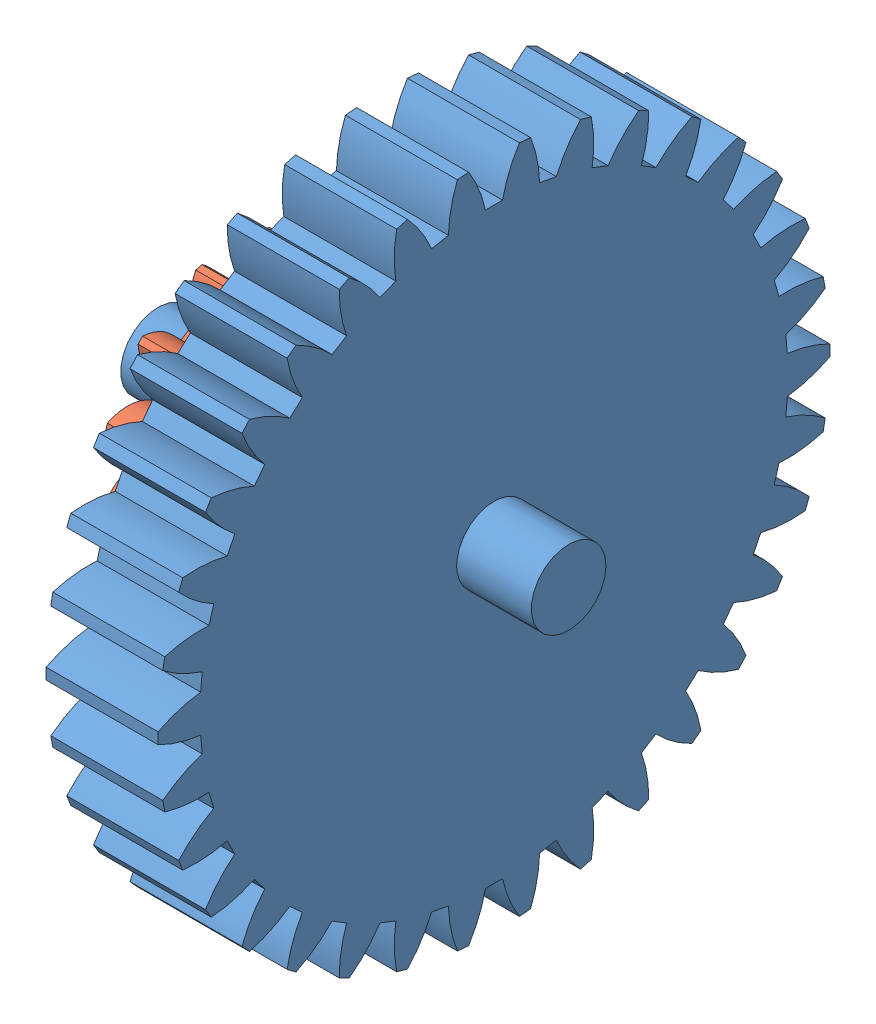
SolidWorks assembly 34T-12T_gear.SLDASM, configuration ﾃﾞﾌｫﾙﾄ (file format 3400). Lengths in mm.
Overall size (11 17.95 18).
2 component instances, 2 part files, 3 mates.
Components (placement in the parent):
- 34T_gear-1: 34T_gear.SLDPRT [JIS - Spur gear 0.5M 34T 20PA 3FW ---S34A11H4.5L1.0N] at (0.291 -1.6307 0.1628) size (11 17.95 18)
- 12T_gear-1: 12T_gear.SLDPRT [JIS - Spur gear 0.5M 12T 20PA 4FW ---S12A11H4.5L2.0N] at (-3.709 -1.6307 0.1628) size (4 6.8 6.8)
Mates (geometry in assembly coordinates):
- 同心円1: concentric anti-aligned: cylinder of ?; cylinder of ?
- 一致1: coincident anti-aligned: plane of ?; plane of ?
- 一致2: coincident aligned: plane of ?; plane of ?
